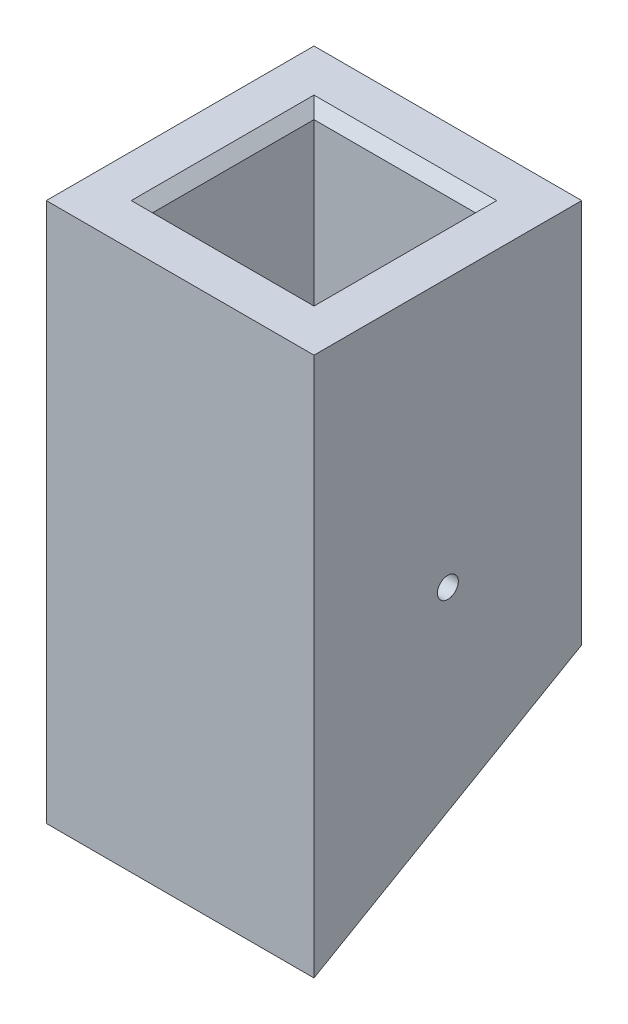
ISO-10303-21;
HEADER;
FILE_DESCRIPTION(('STEP AP214'),'2;1');
FILE_NAME('part.step','',(''),(''),'','','');
FILE_SCHEMA(('AUTOMOTIVE_DESIGN { 1 0 10303 214 1 1 1 1 }'));
ENDSEC;
DATA;
#1=APPLICATION_CONTEXT('core data for automotive mechanical design processes');
#2=APPLICATION_PROTOCOL_DEFINITION('international standard','automotive_design',2000,#1);
#3=PRODUCT_CONTEXT('',#1,'mechanical');
#4=PRODUCT('Part','Part','',(#3));
#5=PRODUCT_RELATED_PRODUCT_CATEGORY('part','',(#4));
#6=PRODUCT_DEFINITION_FORMATION('','',#4);
#7=PRODUCT_DEFINITION_CONTEXT('part definition',#1,'design');
#8=PRODUCT_DEFINITION('design','',#6,#7);
#9=PRODUCT_DEFINITION_SHAPE('','',#8);
#10=(LENGTH_UNIT() NAMED_UNIT(*) SI_UNIT(.MILLI.,.METRE.));
#11=(NAMED_UNIT(*) PLANE_ANGLE_UNIT() SI_UNIT($,.RADIAN.));
#12=(NAMED_UNIT(*) SI_UNIT($,.STERADIAN.) SOLID_ANGLE_UNIT());
#13=UNCERTAINTY_MEASURE_WITH_UNIT(LENGTH_MEASURE(1.E-05),#10,'distance_accuracy_value','');
#14=(GEOMETRIC_REPRESENTATION_CONTEXT(3) GLOBAL_UNCERTAINTY_ASSIGNED_CONTEXT((#13)) GLOBAL_UNIT_ASSIGNED_CONTEXT((#10,
#11,#12)) REPRESENTATION_CONTEXT('',''));
#15=CARTESIAN_POINT('',(0.,0.,0.));
#16=DIRECTION('',(0.,0.,1.));
#17=DIRECTION('',(1.,0.,0.));
#18=AXIS2_PLACEMENT_3D('',#15,#16,#17);
#19=CARTESIAN_POINT('',(0.,57.15,-9.652));
#20=DIRECTION('',(0.,0.,-1.));
#21=DIRECTION('',(-1.,0.,0.));
#22=AXIS2_PLACEMENT_3D('',#19,#20,#21);
#23=PLANE('',#22);
#24=DIRECTION('',(0.,-1.,0.));
#25=VECTOR('',#24,1.);
#26=CARTESIAN_POINT('',(9.652,57.15,-9.652));
#27=LINE('',#26,#25);
#28=CARTESIAN_POINT('',(9.652,55.88,-9.652));
#29=VERTEX_POINT('',#28);
#30=CARTESIAN_POINT('',(9.652,14.8113438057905,-9.652));
#31=VERTEX_POINT('',#30);
#32=EDGE_CURVE('E188',#29,#31,#27,.T.);
#33=ORIENTED_EDGE('',*,*,#32,.F.);
#34=DIRECTION('',(-1.,0.,0.));
#35=VECTOR('',#34,1.);
#36=CARTESIAN_POINT('',(-9.652,55.88,-9.652));
#37=LINE('',#36,#35);
#38=CARTESIAN_POINT('',(-9.652,55.88,-9.652));
#39=VERTEX_POINT('',#38);
#40=EDGE_CURVE('E11',#29,#39,#37,.T.);
#41=ORIENTED_EDGE('',*,*,#40,.T.);
#42=DIRECTION('',(0.,-1.,0.));
#43=VECTOR('',#42,1.);
#44=CARTESIAN_POINT('',(-9.652,57.15,-9.652));
#45=LINE('',#44,#43);
#46=CARTESIAN_POINT('',(-9.652,14.8113438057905,-9.652));
#47=VERTEX_POINT('',#46);
#48=EDGE_CURVE('E181',#39,#47,#45,.T.);
#49=ORIENTED_EDGE('',*,*,#48,.T.);
#50=DIRECTION('',(1.,0.,0.));
#51=VECTOR('',#50,1.);
#52=CARTESIAN_POINT('',(0.,14.8113438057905,-9.652));
#53=LINE('',#52,#51);
#54=EDGE_CURVE('E170',#47,#31,#53,.T.);
#55=ORIENTED_EDGE('',*,*,#54,.T.);
#56=EDGE_LOOP('',(#33,#41,#49,#55));
#57=FACE_BOUND('',#56,.T.);
#58=ADVANCED_FACE('F41',(#57),#23,.F.);
#59=CARTESIAN_POINT('',(9.652,57.15,0.));
#60=DIRECTION('',(1.,0.,0.));
#61=DIRECTION('',(0.,0.,-1.));
#62=AXIS2_PLACEMENT_3D('',#59,#60,#61);
#63=PLANE('',#62);
#64=CARTESIAN_POINT('',(9.652,25.1137590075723,0.));
#65=DIRECTION('',(1.,0.,0.));
#66=DIRECTION('',(0.,0.,-1.));
#67=AXIS2_PLACEMENT_3D('',#64,#65,#66);
#68=CIRCLE('',#67,1.25);
#69=CARTESIAN_POINT('',(9.652,25.1137590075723,-1.25));
#70=VERTEX_POINT('',#69);
#71=EDGE_CURVE('E158',#70,#70,#68,.T.);
#72=ORIENTED_EDGE('',*,*,#71,.T.);
#73=EDGE_LOOP('',(#72));
#74=FACE_BOUND('',#73,.T.);
#75=DIRECTION('',(0.,-1.,0.));
#76=VECTOR('',#75,1.);
#77=CARTESIAN_POINT('',(9.652,57.15,9.652));
#78=LINE('',#77,#76);
#79=CARTESIAN_POINT('',(9.652,55.88,9.652));
#80=VERTEX_POINT('',#79);
#81=CARTESIAN_POINT('',(9.652,3.66617420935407,9.652));
#82=VERTEX_POINT('',#81);
#83=EDGE_CURVE('E186',#80,#82,#78,.T.);
#84=ORIENTED_EDGE('',*,*,#83,.F.);
#85=DIRECTION('',(0.,0.,-1.));
#86=VECTOR('',#85,1.);
#87=CARTESIAN_POINT('',(9.652,55.88,-9.652));
#88=LINE('',#87,#86);
#89=EDGE_CURVE('E204',#80,#29,#88,.T.);
#90=ORIENTED_EDGE('',*,*,#89,.T.);
#91=ORIENTED_EDGE('',*,*,#32,.T.);
#92=DIRECTION('',(0.,-0.499999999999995,0.866025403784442));
#93=VECTOR('',#92,1.);
#94=CARTESIAN_POINT('',(9.652,21.2165692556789,-20.7461759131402));
#95=LINE('',#94,#93);
#96=EDGE_CURVE('E167',#31,#82,#95,.T.);
#97=ORIENTED_EDGE('',*,*,#96,.T.);
#98=EDGE_LOOP('',(#84,#90,#91,#97));
#99=FACE_BOUND('',#98,.T.);
#100=ADVANCED_FACE('F234',(#74,#99),#63,.F.);
#101=CARTESIAN_POINT('',(0.,57.15,9.652));
#102=DIRECTION('',(0.,0.,-1.));
#103=DIRECTION('',(-1.,0.,0.));
#104=AXIS2_PLACEMENT_3D('',#101,#102,#103);
#105=PLANE('',#104);
#106=DIRECTION('',(0.,-1.,0.));
#107=VECTOR('',#106,1.);
#108=CARTESIAN_POINT('',(-9.652,57.15,9.652));
#109=LINE('',#108,#107);
#110=CARTESIAN_POINT('',(-9.652,55.88,9.652));
#111=VERTEX_POINT('',#110);
#112=CARTESIAN_POINT('',(-9.652,3.66617420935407,9.652));
#113=VERTEX_POINT('',#112);
#114=EDGE_CURVE('E183',#111,#113,#109,.T.);
#115=ORIENTED_EDGE('',*,*,#114,.F.);
#116=DIRECTION('',(1.,0.,0.));
#117=VECTOR('',#116,1.);
#118=CARTESIAN_POINT('',(0.,55.88,9.652));
#119=LINE('',#118,#117);
#120=EDGE_CURVE('E207',#111,#80,#119,.T.);
#121=ORIENTED_EDGE('',*,*,#120,.T.);
#122=ORIENTED_EDGE('',*,*,#83,.T.);
#123=DIRECTION('',(1.,0.,0.));
#124=VECTOR('',#123,1.);
#125=CARTESIAN_POINT('',(0.,3.66617420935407,9.652));
#126=LINE('',#125,#124);
#127=EDGE_CURVE('E164',#113,#82,#126,.T.);
#128=ORIENTED_EDGE('',*,*,#127,.F.);
#129=EDGE_LOOP('',(#115,#121,#122,#128));
#130=FACE_BOUND('',#129,.T.);
#131=ADVANCED_FACE('F242',(#130),#105,.T.);
#132=CARTESIAN_POINT('',(0.,57.15,-16.002));
#133=DIRECTION('',(0.,0.,-1.));
#134=DIRECTION('',(-1.,0.,0.));
#135=AXIS2_PLACEMENT_3D('',#132,#133,#134);
#136=PLANE('',#135);
#137=DIRECTION('',(0.,-1.,0.));
#138=VECTOR('',#137,1.);
#139=CARTESIAN_POINT('',(16.002,57.15,-16.002));
#140=LINE('',#139,#138);
#141=CARTESIAN_POINT('',(16.002,57.15,-16.002));
#142=VERTEX_POINT('',#141);
#143=CARTESIAN_POINT('',(16.002,11.1451695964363,-16.002));
#144=VERTEX_POINT('',#143);
#145=EDGE_CURVE('E130',#142,#144,#140,.T.);
#146=ORIENTED_EDGE('',*,*,#145,.T.);
#147=DIRECTION('',(1.,0.,0.));
#148=VECTOR('',#147,1.);
#149=CARTESIAN_POINT('',(-57.1165378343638,11.1451695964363,-16.002));
#150=LINE('',#149,#148);
#151=CARTESIAN_POINT('',(-16.002,11.1451695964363,-16.002));
#152=VERTEX_POINT('',#151);
#153=EDGE_CURVE('E139',#152,#144,#150,.T.);
#154=ORIENTED_EDGE('',*,*,#153,.F.);
#155=DIRECTION('',(0.,-1.,0.));
#156=VECTOR('',#155,1.);
#157=CARTESIAN_POINT('',(-16.002,57.15,-16.002));
#158=LINE('',#157,#156);
#159=CARTESIAN_POINT('',(-16.002,57.15,-16.002));
#160=VERTEX_POINT('',#159);
#161=EDGE_CURVE('E184',#160,#152,#158,.T.);
#162=ORIENTED_EDGE('',*,*,#161,.F.);
#163=DIRECTION('',(1.,0.,0.));
#164=VECTOR('',#163,1.);
#165=CARTESIAN_POINT('',(0.,57.15,-16.002));
#166=LINE('',#165,#164);
#167=EDGE_CURVE('E173',#160,#142,#166,.T.);
#168=ORIENTED_EDGE('',*,*,#167,.T.);
#169=EDGE_LOOP('',(#146,#154,#162,#168));
#170=FACE_BOUND('',#169,.T.);
#171=ADVANCED_FACE('F270',(#170),#136,.T.);
#172=CARTESIAN_POINT('',(-16.002,57.15,0.));
#173=DIRECTION('',(1.,0.,0.));
#174=DIRECTION('',(0.,0.,-1.));
#175=AXIS2_PLACEMENT_3D('',#172,#173,#174);
#176=PLANE('',#175);
#177=CARTESIAN_POINT('',(-16.002,25.1137590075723,0.));
#178=DIRECTION('',(1.,0.,0.));
#179=DIRECTION('',(0.,0.,-1.));
#180=AXIS2_PLACEMENT_3D('',#177,#178,#179);
#181=CIRCLE('',#180,1.25);
#182=CARTESIAN_POINT('',(-16.002,25.1137590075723,-1.25));
#183=VERTEX_POINT('',#182);
#184=EDGE_CURVE('E155',#183,#183,#181,.T.);
#185=ORIENTED_EDGE('',*,*,#184,.T.);
#186=EDGE_LOOP('',(#185));
#187=FACE_BOUND('',#186,.T.);
#188=ORIENTED_EDGE('',*,*,#161,.T.);
#189=DIRECTION('',(0.,-0.5,0.866025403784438));
#190=VECTOR('',#189,1.);
#191=CARTESIAN_POINT('',(-16.002,-7.3323484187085,16.002));
#192=LINE('',#191,#190);
#193=CARTESIAN_POINT('',(-16.002,-7.33234841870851,16.002));
#194=VERTEX_POINT('',#193);
#195=EDGE_CURVE('E149',#152,#194,#192,.T.);
#196=ORIENTED_EDGE('',*,*,#195,.T.);
#197=DIRECTION('',(0.,-1.,0.));
#198=VECTOR('',#197,1.);
#199=CARTESIAN_POINT('',(-16.002,57.15,16.002));
#200=LINE('',#199,#198);
#201=CARTESIAN_POINT('',(-16.002,57.15,16.002));
#202=VERTEX_POINT('',#201);
#203=EDGE_CURVE('E129',#202,#194,#200,.T.);
#204=ORIENTED_EDGE('',*,*,#203,.F.);
#205=DIRECTION('',(0.,0.,1.));
#206=VECTOR('',#205,1.);
#207=CARTESIAN_POINT('',(-16.002,57.15,0.));
#208=LINE('',#207,#206);
#209=EDGE_CURVE('E176',#160,#202,#208,.T.);
#210=ORIENTED_EDGE('',*,*,#209,.F.);
#211=EDGE_LOOP('',(#188,#196,#204,#210));
#212=FACE_BOUND('',#211,.T.);
#213=ADVANCED_FACE('F267',(#187,#212),#176,.F.);
#214=CARTESIAN_POINT('',(0.,57.15,16.002));
#215=DIRECTION('',(0.,0.,-1.));
#216=DIRECTION('',(-1.,0.,0.));
#217=AXIS2_PLACEMENT_3D('',#214,#215,#216);
#218=PLANE('',#217);
#219=ORIENTED_EDGE('',*,*,#203,.T.);
#220=DIRECTION('',(1.,0.,0.));
#221=VECTOR('',#220,1.);
#222=CARTESIAN_POINT('',(-57.1165378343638,-7.33234841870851,16.002));
#223=LINE('',#222,#221);
#224=CARTESIAN_POINT('',(16.002,-7.33234841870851,16.002));
#225=VERTEX_POINT('',#224);
#226=EDGE_CURVE('E133',#194,#225,#223,.T.);
#227=ORIENTED_EDGE('',*,*,#226,.T.);
#228=DIRECTION('',(0.,-1.,0.));
#229=VECTOR('',#228,1.);
#230=CARTESIAN_POINT('',(16.002,57.15,16.002));
#231=LINE('',#230,#229);
#232=CARTESIAN_POINT('',(16.002,57.15,16.002));
#233=VERTEX_POINT('',#232);
#234=EDGE_CURVE('E120',#233,#225,#231,.T.);
#235=ORIENTED_EDGE('',*,*,#234,.F.);
#236=DIRECTION('',(1.,0.,0.));
#237=VECTOR('',#236,1.);
#238=CARTESIAN_POINT('',(0.,57.15,16.002));
#239=LINE('',#238,#237);
#240=EDGE_CURVE('E178',#202,#233,#239,.T.);
#241=ORIENTED_EDGE('',*,*,#240,.F.);
#242=EDGE_LOOP('',(#219,#227,#235,#241));
#243=FACE_BOUND('',#242,.T.);
#244=ADVANCED_FACE('F134',(#243),#218,.F.);
#245=CARTESIAN_POINT('',(16.002,57.15,0.));
#246=DIRECTION('',(1.,0.,0.));
#247=DIRECTION('',(0.,0.,-1.));
#248=AXIS2_PLACEMENT_3D('',#245,#246,#247);
#249=PLANE('',#248);
#250=CARTESIAN_POINT('',(16.002,25.1137590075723,0.));
#251=DIRECTION('',(1.,0.,0.));
#252=DIRECTION('',(0.,0.,-1.));
#253=AXIS2_PLACEMENT_3D('',#250,#251,#252);
#254=CIRCLE('',#253,1.25);
#255=CARTESIAN_POINT('',(16.002,25.1137590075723,-1.25));
#256=VERTEX_POINT('',#255);
#257=EDGE_CURVE('E151',#256,#256,#254,.T.);
#258=ORIENTED_EDGE('',*,*,#257,.F.);
#259=EDGE_LOOP('',(#258));
#260=FACE_BOUND('',#259,.T.);
#261=ORIENTED_EDGE('',*,*,#234,.T.);
#262=DIRECTION('',(0.,0.5,-0.866025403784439));
#263=VECTOR('',#262,1.);
#264=CARTESIAN_POINT('',(16.002,-7.33234841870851,16.002));
#265=LINE('',#264,#263);
#266=EDGE_CURVE('E124',#225,#144,#265,.T.);
#267=ORIENTED_EDGE('',*,*,#266,.T.);
#268=ORIENTED_EDGE('',*,*,#145,.F.);
#269=DIRECTION('',(0.,0.,1.));
#270=VECTOR('',#269,1.);
#271=CARTESIAN_POINT('',(16.002,57.15,0.));
#272=LINE('',#271,#270);
#273=EDGE_CURVE('E126',#142,#233,#272,.T.);
#274=ORIENTED_EDGE('',*,*,#273,.T.);
#275=EDGE_LOOP('',(#261,#267,#268,#274));
#276=FACE_BOUND('',#275,.T.);
#277=ADVANCED_FACE('F122',(#260,#276),#249,.T.);
#278=CARTESIAN_POINT('',(-9.652,57.15,0.));
#279=DIRECTION('',(1.,0.,0.));
#280=DIRECTION('',(0.,0.,-1.));
#281=AXIS2_PLACEMENT_3D('',#278,#279,#280);
#282=PLANE('',#281);
#283=CARTESIAN_POINT('',(-9.652,25.1137590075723,0.));
#284=DIRECTION('',(1.,0.,0.));
#285=DIRECTION('',(0.,0.,-1.));
#286=AXIS2_PLACEMENT_3D('',#283,#284,#285);
#287=CIRCLE('',#286,1.25);
#288=CARTESIAN_POINT('',(-9.652,25.1137590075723,-1.25));
#289=VERTEX_POINT('',#288);
#290=EDGE_CURVE('E154',#289,#289,#287,.T.);
#291=ORIENTED_EDGE('',*,*,#290,.F.);
#292=EDGE_LOOP('',(#291));
#293=FACE_BOUND('',#292,.T.);
#294=ORIENTED_EDGE('',*,*,#48,.F.);
#295=DIRECTION('',(0.,0.,1.));
#296=VECTOR('',#295,1.);
#297=CARTESIAN_POINT('',(-9.652,55.88,0.));
#298=LINE('',#297,#296);
#299=EDGE_CURVE('E51',#39,#111,#298,.T.);
#300=ORIENTED_EDGE('',*,*,#299,.T.);
#301=ORIENTED_EDGE('',*,*,#114,.T.);
#302=DIRECTION('',(0.,-0.499999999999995,0.866025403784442));
#303=VECTOR('',#302,1.);
#304=CARTESIAN_POINT('',(-9.652,21.2165692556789,-20.7461759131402));
#305=LINE('',#304,#303);
#306=EDGE_CURVE('E161',#47,#113,#305,.T.);
#307=ORIENTED_EDGE('',*,*,#306,.F.);
#308=EDGE_LOOP('',(#294,#300,#301,#307));
#309=FACE_BOUND('',#308,.T.);
#310=ADVANCED_FACE('F243',(#293,#309),#282,.T.);
#311=CARTESIAN_POINT('',(0.,57.15,0.));
#312=DIRECTION('',(0.,1.,0.));
#313=DIRECTION('',(0.,0.,1.));
#314=AXIS2_PLACEMENT_3D('',#311,#312,#313);
#315=PLANE('',#314);
#316=DIRECTION('',(1.,0.,0.));
#317=VECTOR('',#316,1.);
#318=CARTESIAN_POINT('',(9.652,57.15,-10.922));
#319=LINE('',#318,#317);
#320=CARTESIAN_POINT('',(-10.922,57.15,-10.922));
#321=VERTEX_POINT('',#320);
#322=CARTESIAN_POINT('',(10.922,57.15,-10.922));
#323=VERTEX_POINT('',#322);
#324=EDGE_CURVE('E190',#321,#323,#319,.T.);
#325=ORIENTED_EDGE('',*,*,#324,.T.);
#326=DIRECTION('',(0.,0.,1.));
#327=VECTOR('',#326,1.);
#328=CARTESIAN_POINT('',(10.922,57.15,9.652));
#329=LINE('',#328,#327);
#330=CARTESIAN_POINT('',(10.922,57.15,10.922));
#331=VERTEX_POINT('',#330);
#332=EDGE_CURVE('E201',#323,#331,#329,.T.);
#333=ORIENTED_EDGE('',*,*,#332,.T.);
#334=DIRECTION('',(-1.,0.,0.));
#335=VECTOR('',#334,1.);
#336=CARTESIAN_POINT('',(0.,57.15,10.922));
#337=LINE('',#336,#335);
#338=CARTESIAN_POINT('',(-10.922,57.15,10.922));
#339=VERTEX_POINT('',#338);
#340=EDGE_CURVE('E199',#331,#339,#337,.T.);
#341=ORIENTED_EDGE('',*,*,#340,.T.);
#342=DIRECTION('',(0.,0.,-1.));
#343=VECTOR('',#342,1.);
#344=CARTESIAN_POINT('',(-10.922,57.15,0.));
#345=LINE('',#344,#343);
#346=EDGE_CURVE('E197',#339,#321,#345,.T.);
#347=ORIENTED_EDGE('',*,*,#346,.T.);
#348=EDGE_LOOP('',(#325,#333,#341,#347));
#349=FACE_BOUND('',#348,.T.);
#350=ORIENTED_EDGE('',*,*,#167,.F.);
#351=ORIENTED_EDGE('',*,*,#209,.T.);
#352=ORIENTED_EDGE('',*,*,#240,.T.);
#353=ORIENTED_EDGE('',*,*,#273,.F.);
#354=EDGE_LOOP('',(#350,#351,#352,#353));
#355=FACE_BOUND('',#354,.T.);
#356=ADVANCED_FACE('F225',(#349,#355),#315,.T.);
#357=CARTESIAN_POINT('',(-41.148,25.1137590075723,0.));
#358=DIRECTION('',(1.,0.,0.));
#359=DIRECTION('',(0.,0.,-1.));
#360=AXIS2_PLACEMENT_3D('',#357,#358,#359);
#361=CYLINDRICAL_SURFACE('',#360,1.25);
#362=ORIENTED_EDGE('',*,*,#290,.T.);
#363=EDGE_LOOP('',(#362));
#364=FACE_BOUND('',#363,.T.);
#365=ORIENTED_EDGE('',*,*,#184,.F.);
#366=EDGE_LOOP('',(#365));
#367=FACE_BOUND('',#366,.T.);
#368=ADVANCED_FACE('F251',(#364,#367),#361,.F.);
#369=ORIENTED_EDGE('',*,*,#257,.T.);
#370=EDGE_LOOP('',(#369));
#371=FACE_BOUND('',#370,.T.);
#372=ORIENTED_EDGE('',*,*,#71,.F.);
#373=EDGE_LOOP('',(#372));
#374=FACE_BOUND('',#373,.T.);
#375=ADVANCED_FACE('F300',(#371,#374),#361,.F.);
#376=CARTESIAN_POINT('',(-57.1165378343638,-7.33234841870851,16.002));
#377=DIRECTION('',(0.,-0.866025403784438,-0.5));
#378=DIRECTION('',(0.,0.5,-0.866025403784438));
#379=AXIS2_PLACEMENT_3D('',#376,#377,#378);
#380=PLANE('',#379);
#381=ORIENTED_EDGE('',*,*,#195,.F.);
#382=ORIENTED_EDGE('',*,*,#153,.T.);
#383=ORIENTED_EDGE('',*,*,#266,.F.);
#384=ORIENTED_EDGE('',*,*,#226,.F.);
#385=EDGE_LOOP('',(#381,#382,#383,#384));
#386=FACE_BOUND('',#385,.T.);
#387=ADVANCED_FACE('F142',(#386),#380,.T.);
#388=CARTESIAN_POINT('',(-57.1165378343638,0.,16.002));
#389=DIRECTION('',(0.,0.866025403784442,0.499999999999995));
#390=DIRECTION('',(0.,-0.499999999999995,0.866025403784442));
#391=AXIS2_PLACEMENT_3D('',#388,#389,#390);
#392=PLANE('',#391);
#393=ORIENTED_EDGE('',*,*,#54,.F.);
#394=ORIENTED_EDGE('',*,*,#306,.T.);
#395=ORIENTED_EDGE('',*,*,#127,.T.);
#396=ORIENTED_EDGE('',*,*,#96,.F.);
#397=EDGE_LOOP('',(#393,#394,#395,#396));
#398=FACE_BOUND('',#397,.T.);
#399=ADVANCED_FACE('F239',(#398),#392,.T.);
#400=CARTESIAN_POINT('',(-9.652,55.88,0.));
#401=DIRECTION('',(-0.707106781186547,-0.707106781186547,0.));
#402=DIRECTION('',(0.,0.,1.));
#403=AXIS2_PLACEMENT_3D('',#400,#401,#402);
#404=PLANE('',#403);
#405=DIRECTION('',(0.577350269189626,-0.577350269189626,-0.577350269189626));
#406=VECTOR('',#405,1.);
#407=CARTESIAN_POINT('',(-6.43466666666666,52.6626666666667,6.43466666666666));
#408=LINE('',#407,#406);
#409=EDGE_CURVE('E146',#111,#339,#408,.F.);
#410=ORIENTED_EDGE('',*,*,#409,.F.);
#411=ORIENTED_EDGE('',*,*,#299,.F.);
#412=DIRECTION('',(-0.577350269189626,0.577350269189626,-0.577350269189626));
#413=VECTOR('',#412,1.);
#414=CARTESIAN_POINT('',(-6.43466666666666,52.6626666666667,-6.43466666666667));
#415=LINE('',#414,#413);
#416=EDGE_CURVE('E46',#321,#39,#415,.F.);
#417=ORIENTED_EDGE('',*,*,#416,.F.);
#418=ORIENTED_EDGE('',*,*,#346,.F.);
#419=EDGE_LOOP('',(#410,#411,#417,#418));
#420=FACE_BOUND('',#419,.T.);
#421=ADVANCED_FACE('F44',(#420),#404,.F.);
#422=CARTESIAN_POINT('',(0.,57.15,-10.922));
#423=DIRECTION('',(0.,0.707106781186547,0.707106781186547));
#424=DIRECTION('',(-1.,0.,0.));
#425=AXIS2_PLACEMENT_3D('',#422,#423,#424);
#426=PLANE('',#425);
#427=ORIENTED_EDGE('',*,*,#416,.T.);
#428=ORIENTED_EDGE('',*,*,#40,.F.);
#429=DIRECTION('',(0.577350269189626,0.577350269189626,-0.577350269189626));
#430=VECTOR('',#429,1.);
#431=CARTESIAN_POINT('',(7.28133333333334,53.5093333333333,-7.28133333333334));
#432=LINE('',#431,#430);
#433=EDGE_CURVE('E212',#323,#29,#432,.F.);
#434=ORIENTED_EDGE('',*,*,#433,.F.);
#435=ORIENTED_EDGE('',*,*,#324,.F.);
#436=EDGE_LOOP('',(#427,#428,#434,#435));
#437=FACE_BOUND('',#436,.T.);
#438=ADVANCED_FACE('F285',(#437),#426,.T.);
#439=CARTESIAN_POINT('',(0.,55.88,9.652));
#440=DIRECTION('',(0.,-0.707106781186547,0.707106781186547));
#441=DIRECTION('',(1.,0.,0.));
#442=AXIS2_PLACEMENT_3D('',#439,#440,#441);
#443=PLANE('',#442);
#444=ORIENTED_EDGE('',*,*,#409,.T.);
#445=ORIENTED_EDGE('',*,*,#340,.F.);
#446=DIRECTION('',(0.577350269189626,0.577350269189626,0.577350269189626));
#447=VECTOR('',#446,1.);
#448=CARTESIAN_POINT('',(7.28133333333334,53.5093333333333,7.28133333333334));
#449=LINE('',#448,#447);
#450=EDGE_CURVE('E210',#80,#331,#449,.T.);
#451=ORIENTED_EDGE('',*,*,#450,.F.);
#452=ORIENTED_EDGE('',*,*,#120,.F.);
#453=EDGE_LOOP('',(#444,#445,#451,#452));
#454=FACE_BOUND('',#453,.T.);
#455=ADVANCED_FACE('F218',(#454),#443,.F.);
#456=CARTESIAN_POINT('',(10.922,57.15,0.));
#457=DIRECTION('',(-0.707106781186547,0.707106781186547,0.));
#458=DIRECTION('',(0.,0.,-1.));
#459=AXIS2_PLACEMENT_3D('',#456,#457,#458);
#460=PLANE('',#459);
#461=ORIENTED_EDGE('',*,*,#433,.T.);
#462=ORIENTED_EDGE('',*,*,#89,.F.);
#463=ORIENTED_EDGE('',*,*,#450,.T.);
#464=ORIENTED_EDGE('',*,*,#332,.F.);
#465=EDGE_LOOP('',(#461,#462,#463,#464));
#466=FACE_BOUND('',#465,.T.);
#467=ADVANCED_FACE('F230',(#466),#460,.T.);
#468=CLOSED_SHELL('',(#58,#100,#131,#171,#213,#244,#277,#310,#356,#368,#375,#387,#399,#421,#438,
#455,#467));
#469=MANIFOLD_SOLID_BREP('B2',#468);
#470=ADVANCED_BREP_SHAPE_REPRESENTATION('',(#18,#469),#14);
#471=SHAPE_DEFINITION_REPRESENTATION(#9,#470);
ENDSEC;
END-ISO-10303-21;
